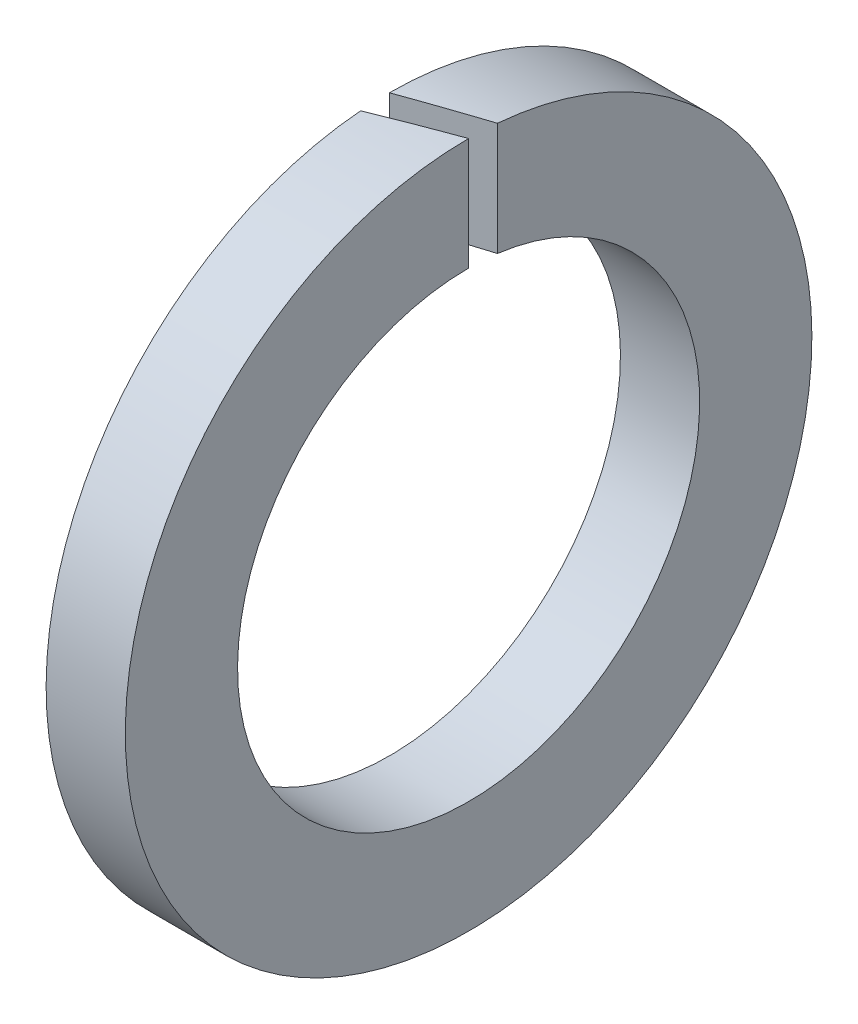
ISO-10303-21;
HEADER;
FILE_DESCRIPTION(('STEP AP214'),'2;1');
FILE_NAME('part.step','',(''),(''),'','','');
FILE_SCHEMA(('AUTOMOTIVE_DESIGN { 1 0 10303 214 1 1 1 1 }'));
ENDSEC;
DATA;
#1=APPLICATION_CONTEXT('core data for automotive mechanical design processes');
#2=APPLICATION_PROTOCOL_DEFINITION('international standard','automotive_design',2000,#1);
#3=PRODUCT_CONTEXT('',#1,'mechanical');
#4=PRODUCT('Part','Part','',(#3));
#5=PRODUCT_RELATED_PRODUCT_CATEGORY('part','',(#4));
#6=PRODUCT_DEFINITION_FORMATION('','',#4);
#7=PRODUCT_DEFINITION_CONTEXT('part definition',#1,'design');
#8=PRODUCT_DEFINITION('design','',#6,#7);
#9=PRODUCT_DEFINITION_SHAPE('','',#8);
#10=(LENGTH_UNIT() NAMED_UNIT(*) SI_UNIT(.MILLI.,.METRE.));
#11=(NAMED_UNIT(*) PLANE_ANGLE_UNIT() SI_UNIT($,.RADIAN.));
#12=(NAMED_UNIT(*) SI_UNIT($,.STERADIAN.) SOLID_ANGLE_UNIT());
#13=UNCERTAINTY_MEASURE_WITH_UNIT(LENGTH_MEASURE(1.E-05),#10,'distance_accuracy_value','');
#14=(GEOMETRIC_REPRESENTATION_CONTEXT(3) GLOBAL_UNCERTAINTY_ASSIGNED_CONTEXT((#13)) GLOBAL_UNIT_ASSIGNED_CONTEXT((#10,
#11,#12)) REPRESENTATION_CONTEXT('',''));
#15=CARTESIAN_POINT('',(0.,0.,0.));
#16=DIRECTION('',(0.,0.,1.));
#17=DIRECTION('',(1.,0.,0.));
#18=AXIS2_PLACEMENT_3D('',#15,#16,#17);
#19=CARTESIAN_POINT('',(0.,0.,-2.6));
#20=DIRECTION('',(1.,0.,0.));
#21=DIRECTION('',(0.,0.,-1.));
#22=AXIS2_PLACEMENT_3D('',#19,#20,#21);
#23=PLANE('',#22);
#24=DIRECTION('',(0.,-1.,0.));
#25=VECTOR('',#24,1.);
#26=CARTESIAN_POINT('',(0.,2.6,0.218382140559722));
#27=LINE('',#26,#25);
#28=CARTESIAN_POINT('',(0.,2.59081246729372,0.218382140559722));
#29=VERTEX_POINT('',#28);
#30=CARTESIAN_POINT('',(0.,1.73632060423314,0.218382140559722));
#31=VERTEX_POINT('',#30);
#32=EDGE_CURVE('E54',#29,#31,#27,.T.);
#33=ORIENTED_EDGE('',*,*,#32,.T.);
#34=CARTESIAN_POINT('',(0.,0.,0.));
#35=DIRECTION('',(-1.,0.,0.));
#36=DIRECTION('',(0.,0.,1.));
#37=AXIS2_PLACEMENT_3D('',#34,#35,#36);
#38=CIRCLE('',#37,1.75);
#39=CARTESIAN_POINT('',(0.,1.75,0.));
#40=VERTEX_POINT('',#39);
#41=EDGE_CURVE('E88',#40,#31,#38,.T.);
#42=ORIENTED_EDGE('',*,*,#41,.F.);
#43=DIRECTION('',(0.,-1.,0.));
#44=VECTOR('',#43,1.);
#45=CARTESIAN_POINT('',(0.,2.6,0.));
#46=LINE('',#45,#44);
#47=CARTESIAN_POINT('',(0.,2.6,0.));
#48=VERTEX_POINT('',#47);
#49=EDGE_CURVE('E97',#48,#40,#46,.T.);
#50=ORIENTED_EDGE('',*,*,#49,.F.);
#51=CARTESIAN_POINT('',(0.,0.,0.));
#52=DIRECTION('',(-1.,0.,0.));
#53=DIRECTION('',(0.,0.,1.));
#54=AXIS2_PLACEMENT_3D('',#51,#52,#53);
#55=CIRCLE('',#54,2.6);
#56=EDGE_CURVE('E86',#48,#29,#55,.T.);
#57=ORIENTED_EDGE('',*,*,#56,.T.);
#58=EDGE_LOOP('',(#33,#42,#50,#57));
#59=FACE_BOUND('',#58,.T.);
#60=ADVANCED_FACE('F33',(#59),#23,.F.);
#61=CARTESIAN_POINT('',(0.,0.,0.));
#62=DIRECTION('',(-1.,0.,0.));
#63=DIRECTION('',(0.,0.,1.));
#64=AXIS2_PLACEMENT_3D('',#61,#62,#63);
#65=CYLINDRICAL_SURFACE('',#64,1.75);
#66=CARTESIAN_POINT('',(0.6,0.,0.));
#67=DIRECTION('',(-0.342020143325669,0.,-0.939692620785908));
#68=DIRECTION('',(-0.939692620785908,0.,0.342020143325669));
#69=AXIS2_PLACEMENT_3D('',#66,#67,#68);
#70=ELLIPSE('',#69,5.11665770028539,1.75);
#71=CARTESIAN_POINT('',(0.6,1.75,0.));
#72=VERTEX_POINT('',#71);
#73=EDGE_CURVE('E90',#72,#31,#70,.F.);
#74=ORIENTED_EDGE('',*,*,#73,.F.);
#75=CARTESIAN_POINT('',(0.6,0.,0.));
#76=DIRECTION('',(-1.,0.,0.));
#77=DIRECTION('',(0.,0.,1.));
#78=AXIS2_PLACEMENT_3D('',#75,#76,#77);
#79=CIRCLE('',#78,1.75);
#80=CARTESIAN_POINT('',(0.6,1.73632060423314,-0.218382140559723));
#81=VERTEX_POINT('',#80);
#82=EDGE_CURVE('E83',#81,#72,#79,.T.);
#83=ORIENTED_EDGE('',*,*,#82,.F.);
#84=CARTESIAN_POINT('',(0.,0.,0.));
#85=DIRECTION('',(0.342020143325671,0.,0.939692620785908));
#86=DIRECTION('',(-0.939692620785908,0.,0.342020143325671));
#87=AXIS2_PLACEMENT_3D('',#84,#85,#86);
#88=ELLIPSE('',#87,5.11665770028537,1.75);
#89=EDGE_CURVE('E105',#40,#81,#88,.F.);
#90=ORIENTED_EDGE('',*,*,#89,.F.);
#91=ORIENTED_EDGE('',*,*,#41,.T.);
#92=EDGE_LOOP('',(#74,#83,#90,#91));
#93=FACE_BOUND('',#92,.T.);
#94=ADVANCED_FACE('F107',(#93),#65,.F.);
#95=CARTESIAN_POINT('',(0.6,0.,-2.6));
#96=DIRECTION('',(-1.,0.,0.));
#97=DIRECTION('',(0.,0.,1.));
#98=AXIS2_PLACEMENT_3D('',#95,#96,#97);
#99=PLANE('',#98);
#100=DIRECTION('',(0.,-1.,0.));
#101=VECTOR('',#100,1.);
#102=CARTESIAN_POINT('',(0.6,2.6,0.));
#103=LINE('',#102,#101);
#104=CARTESIAN_POINT('',(0.6,2.6,0.));
#105=VERTEX_POINT('',#104);
#106=EDGE_CURVE('E71',#105,#72,#103,.T.);
#107=ORIENTED_EDGE('',*,*,#106,.F.);
#108=CARTESIAN_POINT('',(0.6,0.,0.));
#109=DIRECTION('',(-1.,0.,0.));
#110=DIRECTION('',(0.,0.,1.));
#111=AXIS2_PLACEMENT_3D('',#108,#109,#110);
#112=CIRCLE('',#111,2.6);
#113=CARTESIAN_POINT('',(0.6,2.59081246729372,-0.218382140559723));
#114=VERTEX_POINT('',#113);
#115=EDGE_CURVE('E81',#114,#105,#112,.T.);
#116=ORIENTED_EDGE('',*,*,#115,.F.);
#117=DIRECTION('',(0.,-1.,0.));
#118=VECTOR('',#117,1.);
#119=CARTESIAN_POINT('',(0.6,2.6,-0.218382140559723));
#120=LINE('',#119,#118);
#121=EDGE_CURVE('E47',#114,#81,#120,.T.);
#122=ORIENTED_EDGE('',*,*,#121,.T.);
#123=ORIENTED_EDGE('',*,*,#82,.T.);
#124=EDGE_LOOP('',(#107,#116,#122,#123));
#125=FACE_BOUND('',#124,.T.);
#126=ADVANCED_FACE('F80',(#125),#99,.F.);
#127=CARTESIAN_POINT('',(0.,0.,0.));
#128=DIRECTION('',(-1.,0.,0.));
#129=DIRECTION('',(0.,0.,1.));
#130=AXIS2_PLACEMENT_3D('',#127,#128,#129);
#131=CYLINDRICAL_SURFACE('',#130,2.6);
#132=CARTESIAN_POINT('',(0.6,0.,0.));
#133=DIRECTION('',(-0.342020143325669,0.,-0.939692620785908));
#134=DIRECTION('',(-0.939692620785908,0.,0.342020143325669));
#135=AXIS2_PLACEMENT_3D('',#132,#133,#134);
#136=ELLIPSE('',#135,7.60189144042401,2.6);
#137=EDGE_CURVE('E11',#29,#105,#136,.T.);
#138=ORIENTED_EDGE('',*,*,#137,.F.);
#139=ORIENTED_EDGE('',*,*,#56,.F.);
#140=CARTESIAN_POINT('',(0.,0.,0.));
#141=DIRECTION('',(0.342020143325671,0.,0.939692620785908));
#142=DIRECTION('',(-0.939692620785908,0.,0.342020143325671));
#143=AXIS2_PLACEMENT_3D('',#140,#141,#142);
#144=ELLIPSE('',#143,7.60189144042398,2.6);
#145=EDGE_CURVE('E40',#114,#48,#144,.T.);
#146=ORIENTED_EDGE('',*,*,#145,.F.);
#147=ORIENTED_EDGE('',*,*,#115,.T.);
#148=EDGE_LOOP('',(#138,#139,#146,#147));
#149=FACE_BOUND('',#148,.T.);
#150=ADVANCED_FACE('F85',(#149),#131,.T.);
#151=CARTESIAN_POINT('',(0.,2.6,0.));
#152=DIRECTION('',(0.342020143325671,0.,0.939692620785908));
#153=DIRECTION('',(0.939692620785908,0.,-0.342020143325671));
#154=AXIS2_PLACEMENT_3D('',#151,#152,#153);
#155=PLANE('',#154);
#156=ORIENTED_EDGE('',*,*,#89,.T.);
#157=ORIENTED_EDGE('',*,*,#121,.F.);
#158=ORIENTED_EDGE('',*,*,#145,.T.);
#159=ORIENTED_EDGE('',*,*,#49,.T.);
#160=EDGE_LOOP('',(#156,#157,#158,#159));
#161=FACE_BOUND('',#160,.T.);
#162=ADVANCED_FACE('F96',(#161),#155,.T.);
#163=CARTESIAN_POINT('',(0.6,2.6,0.));
#164=DIRECTION('',(-0.342020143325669,0.,-0.939692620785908));
#165=DIRECTION('',(-0.939692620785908,0.,0.342020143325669));
#166=AXIS2_PLACEMENT_3D('',#163,#164,#165);
#167=PLANE('',#166);
#168=ORIENTED_EDGE('',*,*,#73,.T.);
#169=ORIENTED_EDGE('',*,*,#32,.F.);
#170=ORIENTED_EDGE('',*,*,#137,.T.);
#171=ORIENTED_EDGE('',*,*,#106,.T.);
#172=EDGE_LOOP('',(#168,#169,#170,#171));
#173=FACE_BOUND('',#172,.T.);
#174=ADVANCED_FACE('F70',(#173),#167,.T.);
#175=CLOSED_SHELL('',(#60,#94,#126,#150,#162,#174));
#176=MANIFOLD_SOLID_BREP('B2',#175);
#177=ADVANCED_BREP_SHAPE_REPRESENTATION('',(#18,#176),#14);
#178=SHAPE_DEFINITION_REPRESENTATION(#9,#177);
ENDSEC;
END-ISO-10303-21;
